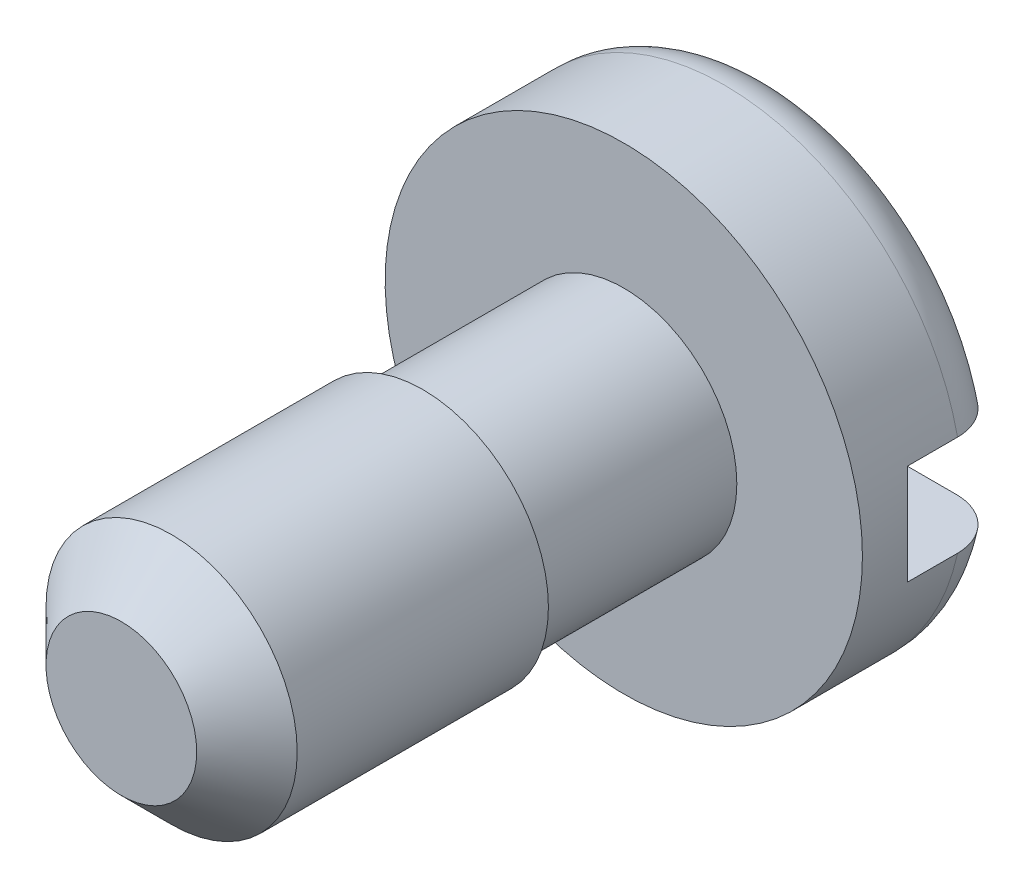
ISO-10303-21;
HEADER;
FILE_DESCRIPTION(('STEP AP214'),'2;1');
FILE_NAME('part.step','',(''),(''),'','','');
FILE_SCHEMA(('AUTOMOTIVE_DESIGN { 1 0 10303 214 1 1 1 1 }'));
ENDSEC;
DATA;
#1=APPLICATION_CONTEXT('core data for automotive mechanical design processes');
#2=APPLICATION_PROTOCOL_DEFINITION('international standard','automotive_design',2000,#1);
#3=PRODUCT_CONTEXT('',#1,'mechanical');
#4=PRODUCT('Part','Part','',(#3));
#5=PRODUCT_RELATED_PRODUCT_CATEGORY('part','',(#4));
#6=PRODUCT_DEFINITION_FORMATION('','',#4);
#7=PRODUCT_DEFINITION_CONTEXT('part definition',#1,'design');
#8=PRODUCT_DEFINITION('design','',#6,#7);
#9=PRODUCT_DEFINITION_SHAPE('','',#8);
#10=(LENGTH_UNIT() NAMED_UNIT(*) SI_UNIT(.MILLI.,.METRE.));
#11=(NAMED_UNIT(*) PLANE_ANGLE_UNIT() SI_UNIT($,.RADIAN.));
#12=(NAMED_UNIT(*) SI_UNIT($,.STERADIAN.) SOLID_ANGLE_UNIT());
#13=UNCERTAINTY_MEASURE_WITH_UNIT(LENGTH_MEASURE(1.E-05),#10,'distance_accuracy_value','');
#14=(GEOMETRIC_REPRESENTATION_CONTEXT(3) GLOBAL_UNCERTAINTY_ASSIGNED_CONTEXT((#13)) GLOBAL_UNIT_ASSIGNED_CONTEXT((#10,
#11,#12)) REPRESENTATION_CONTEXT('',''));
#15=CARTESIAN_POINT('',(0.,0.,0.));
#16=DIRECTION('',(0.,0.,1.));
#17=DIRECTION('',(1.,0.,0.));
#18=AXIS2_PLACEMENT_3D('',#15,#16,#17);
#19=CARTESIAN_POINT('',(0.,0.,0.));
#20=DIRECTION('',(0.,0.,1.));
#21=DIRECTION('',(1.,0.,0.));
#22=AXIS2_PLACEMENT_3D('',#19,#20,#21);
#23=PLANE('',#22);
#24=DIRECTION('',(-1.,0.,0.));
#25=VECTOR('',#24,1.);
#26=CARTESIAN_POINT('',(-25.3564560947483,-0.999999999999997,0.));
#27=LINE('',#26,#25);
#28=CARTESIAN_POINT('',(3.61420807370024,-1.,0.));
#29=VERTEX_POINT('',#28);
#30=CARTESIAN_POINT('',(-3.61420807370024,-1.,0.));
#31=VERTEX_POINT('',#30);
#32=EDGE_CURVE('E122',#29,#31,#27,.T.);
#33=ORIENTED_EDGE('',*,*,#32,.F.);
#34=CARTESIAN_POINT('',(0.,0.,0.));
#35=DIRECTION('',(0.,0.,1.));
#36=DIRECTION('',(1.,0.,0.));
#37=AXIS2_PLACEMENT_3D('',#34,#35,#36);
#38=CIRCLE('',#37,3.75);
#39=EDGE_CURVE('E190',#29,#31,#38,.F.);
#40=ORIENTED_EDGE('',*,*,#39,.T.);
#41=EDGE_LOOP('',(#33,#40));
#42=FACE_BOUND('',#41,.T.);
#43=ADVANCED_FACE('F33',(#42),#23,.F.);
#44=CARTESIAN_POINT('',(0.,0.,3.));
#45=DIRECTION('',(0.,0.,1.));
#46=DIRECTION('',(1.,0.,0.));
#47=AXIS2_PLACEMENT_3D('',#44,#45,#46);
#48=PLANE('',#47);
#49=CARTESIAN_POINT('',(0.,0.,3.));
#50=DIRECTION('',(0.,0.,1.));
#51=DIRECTION('',(1.,0.,0.));
#52=AXIS2_PLACEMENT_3D('',#49,#50,#51);
#53=CIRCLE('',#52,4.75);
#54=CARTESIAN_POINT('',(4.75,0.,3.));
#55=VERTEX_POINT('',#54);
#56=EDGE_CURVE('E108',#55,#55,#53,.T.);
#57=ORIENTED_EDGE('',*,*,#56,.T.);
#58=EDGE_LOOP('',(#57));
#59=FACE_BOUND('',#58,.T.);
#60=CARTESIAN_POINT('',(0.,0.,3.));
#61=DIRECTION('',(0.,0.,1.));
#62=DIRECTION('',(1.,0.,0.));
#63=AXIS2_PLACEMENT_3D('',#60,#61,#62);
#64=CIRCLE('',#63,2.25);
#65=CARTESIAN_POINT('',(2.25,0.,3.));
#66=VERTEX_POINT('',#65);
#67=EDGE_CURVE('E125',#66,#66,#64,.T.);
#68=ORIENTED_EDGE('',*,*,#67,.F.);
#69=EDGE_LOOP('',(#68));
#70=FACE_BOUND('',#69,.T.);
#71=ADVANCED_FACE('F217',(#59,#70),#48,.T.);
#72=CARTESIAN_POINT('',(0.,0.,3.));
#73=DIRECTION('',(0.,0.,-1.));
#74=DIRECTION('',(-1.,0.,0.));
#75=AXIS2_PLACEMENT_3D('',#72,#73,#74);
#76=CYLINDRICAL_SURFACE('',#75,4.75);
#77=DIRECTION('',(0.,0.,-1.));
#78=VECTOR('',#77,1.);
#79=CARTESIAN_POINT('',(4.64354390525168,0.999999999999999,3.));
#80=LINE('',#79,#78);
#81=CARTESIAN_POINT('',(4.64354390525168,0.999999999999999,2.));
#82=VERTEX_POINT('',#81);
#83=CARTESIAN_POINT('',(4.64354390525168,0.999999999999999,1.));
#84=VERTEX_POINT('',#83);
#85=EDGE_CURVE('E100',#82,#84,#80,.T.);
#86=ORIENTED_EDGE('',*,*,#85,.T.);
#87=CARTESIAN_POINT('',(0.,0.,1.));
#88=DIRECTION('',(0.,0.,1.));
#89=DIRECTION('',(1.,0.,0.));
#90=AXIS2_PLACEMENT_3D('',#87,#88,#89);
#91=CIRCLE('',#90,4.75);
#92=CARTESIAN_POINT('',(-4.64354390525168,1.,1.));
#93=VERTEX_POINT('',#92);
#94=EDGE_CURVE('E188',#84,#93,#91,.T.);
#95=ORIENTED_EDGE('',*,*,#94,.T.);
#96=DIRECTION('',(0.,0.,-1.));
#97=VECTOR('',#96,1.);
#98=CARTESIAN_POINT('',(-4.64354390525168,1.,3.));
#99=LINE('',#98,#97);
#100=CARTESIAN_POINT('',(-4.64354390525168,1.,2.));
#101=VERTEX_POINT('',#100);
#102=EDGE_CURVE('E107',#93,#101,#99,.F.);
#103=ORIENTED_EDGE('',*,*,#102,.T.);
#104=CARTESIAN_POINT('',(0.,0.,2.));
#105=DIRECTION('',(0.,0.,-1.));
#106=DIRECTION('',(-1.,0.,0.));
#107=AXIS2_PLACEMENT_3D('',#104,#105,#106);
#108=CIRCLE('',#107,4.75);
#109=CARTESIAN_POINT('',(-4.64354390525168,-1.,2.));
#110=VERTEX_POINT('',#109);
#111=EDGE_CURVE('E97',#110,#101,#108,.T.);
#112=ORIENTED_EDGE('',*,*,#111,.F.);
#113=DIRECTION('',(0.,0.,-1.));
#114=VECTOR('',#113,1.);
#115=CARTESIAN_POINT('',(-4.64354390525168,-1.,3.));
#116=LINE('',#115,#114);
#117=CARTESIAN_POINT('',(-4.64354390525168,-1.,1.));
#118=VERTEX_POINT('',#117);
#119=EDGE_CURVE('E126',#110,#118,#116,.T.);
#120=ORIENTED_EDGE('',*,*,#119,.T.);
#121=CARTESIAN_POINT('',(0.,0.,1.));
#122=DIRECTION('',(0.,0.,1.));
#123=DIRECTION('',(1.,0.,0.));
#124=AXIS2_PLACEMENT_3D('',#121,#122,#123);
#125=CIRCLE('',#124,4.75);
#126=CARTESIAN_POINT('',(4.64354390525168,-1.,1.));
#127=VERTEX_POINT('',#126);
#128=EDGE_CURVE('E138',#118,#127,#125,.T.);
#129=ORIENTED_EDGE('',*,*,#128,.T.);
#130=DIRECTION('',(0.,0.,-1.));
#131=VECTOR('',#130,1.);
#132=CARTESIAN_POINT('',(4.64354390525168,-1.,3.));
#133=LINE('',#132,#131);
#134=CARTESIAN_POINT('',(4.64354390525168,-1.,2.));
#135=VERTEX_POINT('',#134);
#136=EDGE_CURVE('E114',#135,#127,#133,.T.);
#137=ORIENTED_EDGE('',*,*,#136,.F.);
#138=CARTESIAN_POINT('',(4.64354390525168,1.,2.));
#139=DIRECTION('',(0.,-1.,0.));
#140=VECTOR('',#139,1.);
#141=LINE('',#138,#140);
#142=EDGE_CURVE('E93',#82,#135,#141,.T.);
#143=ORIENTED_EDGE('',*,*,#142,.F.);
#144=EDGE_LOOP('',(#86,#95,#103,#112,#120,#129,#137,#143));
#145=FACE_BOUND('',#144,.T.);
#146=ORIENTED_EDGE('',*,*,#56,.F.);
#147=EDGE_LOOP('',(#146));
#148=FACE_BOUND('',#147,.T.);
#149=ADVANCED_FACE('F35',(#145,#148),#76,.T.);
#150=DIRECTION('',(-1.,0.,0.));
#151=VECTOR('',#150,1.);
#152=CARTESIAN_POINT('',(0.,1.,0.));
#153=LINE('',#152,#151);
#154=CARTESIAN_POINT('',(3.61420807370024,1.,0.));
#155=VERTEX_POINT('',#154);
#156=CARTESIAN_POINT('',(-3.61420807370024,1.,0.));
#157=VERTEX_POINT('',#156);
#158=EDGE_CURVE('E123',#155,#157,#153,.T.);
#159=ORIENTED_EDGE('',*,*,#158,.T.);
#160=CARTESIAN_POINT('',(0.,0.,0.));
#161=DIRECTION('',(0.,0.,1.));
#162=DIRECTION('',(1.,0.,0.));
#163=AXIS2_PLACEMENT_3D('',#160,#161,#162);
#164=CIRCLE('',#163,3.75);
#165=EDGE_CURVE('E55',#157,#155,#164,.F.);
#166=ORIENTED_EDGE('',*,*,#165,.T.);
#167=EDGE_LOOP('',(#159,#166));
#168=FACE_BOUND('',#167,.T.);
#169=ADVANCED_FACE('F178',(#168),#23,.F.);
#170=CARTESIAN_POINT('',(0.,0.,7.));
#171=DIRECTION('',(0.,0.,-1.));
#172=DIRECTION('',(-1.,0.,0.));
#173=AXIS2_PLACEMENT_3D('',#170,#171,#172);
#174=CYLINDRICAL_SURFACE('',#173,2.25);
#175=CARTESIAN_POINT('',(0.,0.,7.));
#176=DIRECTION('',(0.,0.,1.));
#177=DIRECTION('',(1.,0.,0.));
#178=AXIS2_PLACEMENT_3D('',#175,#176,#177);
#179=CIRCLE('',#178,2.25);
#180=CARTESIAN_POINT('',(2.25,0.,7.));
#181=VERTEX_POINT('',#180);
#182=EDGE_CURVE('E129',#181,#181,#179,.T.);
#183=ORIENTED_EDGE('',*,*,#182,.F.);
#184=EDGE_LOOP('',(#183));
#185=FACE_BOUND('',#184,.T.);
#186=ORIENTED_EDGE('',*,*,#67,.T.);
#187=EDGE_LOOP('',(#186));
#188=FACE_BOUND('',#187,.T.);
#189=ADVANCED_FACE('F226',(#185,#188),#174,.T.);
#190=CARTESIAN_POINT('',(0.,0.,7.));
#191=DIRECTION('',(0.,0.,1.));
#192=DIRECTION('',(1.,0.,0.));
#193=AXIS2_PLACEMENT_3D('',#190,#191,#192);
#194=PLANE('',#193);
#195=CARTESIAN_POINT('',(0.,0.,7.));
#196=DIRECTION('',(0.,0.,1.));
#197=DIRECTION('',(1.,0.,0.));
#198=AXIS2_PLACEMENT_3D('',#195,#196,#197);
#199=CIRCLE('',#198,2.5);
#200=CARTESIAN_POINT('',(2.5,0.,7.));
#201=VERTEX_POINT('',#200);
#202=EDGE_CURVE('E132',#201,#201,#199,.T.);
#203=ORIENTED_EDGE('',*,*,#202,.F.);
#204=EDGE_LOOP('',(#203));
#205=FACE_BOUND('',#204,.T.);
#206=ORIENTED_EDGE('',*,*,#182,.T.);
#207=EDGE_LOOP('',(#206));
#208=FACE_BOUND('',#207,.T.);
#209=ADVANCED_FACE('F230',(#205,#208),#194,.F.);
#210=CARTESIAN_POINT('',(0.,0.,13.));
#211=DIRECTION('',(0.,0.,-1.));
#212=DIRECTION('',(-1.,0.,0.));
#213=AXIS2_PLACEMENT_3D('',#210,#211,#212);
#214=CYLINDRICAL_SURFACE('',#213,2.5);
#215=CARTESIAN_POINT('',(0.,0.,12.));
#216=DIRECTION('',(0.,0.,1.));
#217=DIRECTION('',(1.,0.,0.));
#218=AXIS2_PLACEMENT_3D('',#215,#216,#217);
#219=CIRCLE('',#218,2.5);
#220=CARTESIAN_POINT('',(2.5,0.,12.));
#221=VERTEX_POINT('',#220);
#222=EDGE_CURVE('E11',#221,#221,#219,.F.);
#223=ORIENTED_EDGE('',*,*,#222,.T.);
#224=EDGE_LOOP('',(#223));
#225=FACE_BOUND('',#224,.T.);
#226=ORIENTED_EDGE('',*,*,#202,.T.);
#227=EDGE_LOOP('',(#226));
#228=FACE_BOUND('',#227,.T.);
#229=ADVANCED_FACE('F239',(#225,#228),#214,.T.);
#230=CARTESIAN_POINT('',(0.,0.,13.));
#231=DIRECTION('',(0.,0.,1.));
#232=DIRECTION('',(1.,0.,0.));
#233=AXIS2_PLACEMENT_3D('',#230,#231,#232);
#234=PLANE('',#233);
#235=CARTESIAN_POINT('',(0.,0.,13.));
#236=DIRECTION('',(0.,0.,1.));
#237=DIRECTION('',(1.,0.,0.));
#238=AXIS2_PLACEMENT_3D('',#235,#236,#237);
#239=CIRCLE('',#238,1.49999999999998);
#240=CARTESIAN_POINT('',(1.49999999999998,0.,13.));
#241=VERTEX_POINT('',#240);
#242=EDGE_CURVE('E42',#241,#241,#239,.T.);
#243=ORIENTED_EDGE('',*,*,#242,.T.);
#244=EDGE_LOOP('',(#243));
#245=FACE_BOUND('',#244,.T.);
#246=ADVANCED_FACE('F237',(#245),#234,.T.);
#247=CARTESIAN_POINT('',(-25.3564560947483,1.,2.));
#248=DIRECTION('',(0.,1.,0.));
#249=DIRECTION('',(-1.,0.,0.));
#250=AXIS2_PLACEMENT_3D('',#247,#248,#249);
#251=PLANE('',#250);
#252=ORIENTED_EDGE('',*,*,#102,.F.);
#253=CARTESIAN_POINT('',(-4.64354390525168,1.,1.));
#254=CARTESIAN_POINT('',(-4.64354397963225,1.,0.972352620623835));
#255=CARTESIAN_POINT('',(-4.64237029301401,1.,0.944718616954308));
#256=CARTESIAN_POINT('',(-4.63768976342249,1.,0.889651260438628));
#257=CARTESIAN_POINT('',(-4.63418311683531,1.,0.862217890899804));
#258=CARTESIAN_POINT('',(-4.62020541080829,1.,0.780591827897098));
#259=CARTESIAN_POINT('',(-4.60627643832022,1.,0.726950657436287));
#260=CARTESIAN_POINT('',(-4.56962497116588,1.,0.622777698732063));
#261=CARTESIAN_POINT('',(-4.54689981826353,1.,0.572246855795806));
#262=CARTESIAN_POINT('',(-4.49335639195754,1.,0.475671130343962));
#263=CARTESIAN_POINT('',(-4.4625383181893,1.,0.429626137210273));
#264=CARTESIAN_POINT('',(-4.39344921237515,1.,0.342892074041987));
#265=CARTESIAN_POINT('',(-4.35511825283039,1.,0.302250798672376));
#266=CARTESIAN_POINT('',(-4.27230010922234,1.,0.227813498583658));
#267=CARTESIAN_POINT('',(-4.22781185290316,1.,0.194018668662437));
#268=CARTESIAN_POINT('',(-4.13294201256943,1.,0.133443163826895));
#269=CARTESIAN_POINT('',(-4.08245420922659,1.,0.106829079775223));
#270=CARTESIAN_POINT('',(-3.97781218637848,1.,0.0621951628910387));
#271=CARTESIAN_POINT('',(-3.92365819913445,1.,0.0441747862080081));
#272=CARTESIAN_POINT('',(-3.82684362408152,1.,0.0204248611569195));
#273=CARTESIAN_POINT('',(-3.78464532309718,1.,0.0127594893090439));
#274=CARTESIAN_POINT('',(-3.69970318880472,1.,0.00254706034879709));
#275=CARTESIAN_POINT('',(-3.6569603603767,1.,-8.34567958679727E-06));
#276=CARTESIAN_POINT('',(-3.61420807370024,1.,0.));
#277=B_SPLINE_CURVE_WITH_KNOTS('',3,(#253,#254,#255,#256,#257,#258,#259,#260,#261,#262,#263,
#264,#265,#266,#267,#268,#269,#270,#271,#272,#273,#274,#275,#276),.UNSPECIFIED.,.F.,.F.,(4,2,2,
2,2,2,2,2,2,2,2,4),(0.,0.0828907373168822,0.165774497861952,0.331179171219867,0.496633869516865,
0.662084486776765,0.828912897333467,0.995770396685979,1.16621858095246,1.33665597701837,
1.46502578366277,1.5931856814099),.UNSPECIFIED.);
#278=EDGE_CURVE('E49',#93,#157,#277,.T.);
#279=ORIENTED_EDGE('',*,*,#278,.T.);
#280=ORIENTED_EDGE('',*,*,#158,.F.);
#281=CARTESIAN_POINT('',(3.61420807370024,1.,0.));
#282=CARTESIAN_POINT('',(3.64388995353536,1.,6.09895041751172E-07));
#283=CARTESIAN_POINT('',(3.67355875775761,1.,0.00122834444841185));
#284=CARTESIAN_POINT('',(3.73269459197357,1.,0.00614207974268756));
#285=CARTESIAN_POINT('',(3.76216160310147,1.,0.00982830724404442));
#286=CARTESIAN_POINT('',(3.8499628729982,1.,0.0245761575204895));
#287=CARTESIAN_POINT('',(3.9077233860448,0.999999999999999,0.0393269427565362));
#288=CARTESIAN_POINT('',(4.0199606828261,0.999999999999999,0.0784071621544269));
#289=CARTESIAN_POINT('',(4.07443354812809,0.999999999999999,0.102747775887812));
#290=CARTESIAN_POINT('',(4.17836546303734,0.999999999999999,0.160426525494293));
#291=CARTESIAN_POINT('',(4.22782755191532,0.999999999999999,0.193759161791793));
#292=CARTESIAN_POINT('',(4.31914117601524,0.999999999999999,0.267703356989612));
#293=CARTESIAN_POINT('',(4.36113862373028,0.999999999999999,0.308134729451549));
#294=CARTESIAN_POINT('',(4.4375273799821,0.999999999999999,0.395665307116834));
#295=CARTESIAN_POINT('',(4.47191737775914,0.999999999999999,0.442765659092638));
#296=CARTESIAN_POINT('',(4.53112058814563,0.999999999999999,0.540887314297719));
#297=CARTESIAN_POINT('',(4.55616906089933,0.999999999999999,0.591766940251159));
#298=CARTESIAN_POINT('',(4.59716051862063,0.999999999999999,0.697047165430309));
#299=CARTESIAN_POINT('',(4.61311213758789,0.999999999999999,0.75144437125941));
#300=CARTESIAN_POINT('',(4.63067419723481,0.999999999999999,0.838575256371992));
#301=CARTESIAN_POINT('',(4.6354982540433,0.999999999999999,0.870694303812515));
#302=CARTESIAN_POINT('',(4.64193171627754,0.999999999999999,0.935203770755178));
#303=CARTESIAN_POINT('',(4.64354595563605,0.999999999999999,0.967593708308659));
#304=CARTESIAN_POINT('',(4.64354390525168,0.999999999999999,1.));
#305=B_SPLINE_CURVE_WITH_KNOTS('',3,(#281,#282,#283,#284,#285,#286,#287,#288,#289,#290,#291,
#292,#293,#294,#295,#296,#297,#298,#299,#300,#301,#302,#303,#304),.UNSPECIFIED.,.F.,.F.,(4,2,2,
2,2,2,2,2,2,2,2,4),(0.,0.0889935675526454,0.177995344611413,0.355921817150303,0.53405632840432,
0.712082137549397,0.886111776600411,1.06017137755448,1.22949170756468,1.39865106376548,
1.4959443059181,1.59309091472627),.UNSPECIFIED.);
#306=EDGE_CURVE('E103',#155,#84,#305,.T.);
#307=ORIENTED_EDGE('',*,*,#306,.T.);
#308=ORIENTED_EDGE('',*,*,#85,.F.);
#309=DIRECTION('',(1.,0.,0.));
#310=VECTOR('',#309,1.);
#311=CARTESIAN_POINT('',(-25.3564560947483,1.,2.));
#312=LINE('',#311,#310);
#313=EDGE_CURVE('E88',#101,#82,#312,.T.);
#314=ORIENTED_EDGE('',*,*,#313,.F.);
#315=EDGE_LOOP('',(#252,#279,#280,#307,#308,#314));
#316=FACE_BOUND('',#315,.T.);
#317=ADVANCED_FACE('F101',(#316),#251,.F.);
#318=CARTESIAN_POINT('',(-25.3564560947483,-0.999999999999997,2.));
#319=DIRECTION('',(0.,-1.,0.));
#320=DIRECTION('',(1.,0.,0.));
#321=AXIS2_PLACEMENT_3D('',#318,#319,#320);
#322=PLANE('',#321);
#323=ORIENTED_EDGE('',*,*,#136,.T.);
#324=CARTESIAN_POINT('',(4.64354390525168,-1.,1.));
#325=CARTESIAN_POINT('',(4.64354397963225,-1.,0.972352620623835));
#326=CARTESIAN_POINT('',(4.64237029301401,-1.,0.944718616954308));
#327=CARTESIAN_POINT('',(4.63768976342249,-1.,0.889651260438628));
#328=CARTESIAN_POINT('',(4.63418311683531,-1.,0.862217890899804));
#329=CARTESIAN_POINT('',(4.62020541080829,-1.,0.780591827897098));
#330=CARTESIAN_POINT('',(4.60627643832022,-1.,0.726950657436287));
#331=CARTESIAN_POINT('',(4.56962497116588,-1.,0.622777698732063));
#332=CARTESIAN_POINT('',(4.54689981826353,-1.,0.572246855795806));
#333=CARTESIAN_POINT('',(4.49335639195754,-1.,0.475671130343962));
#334=CARTESIAN_POINT('',(4.4625383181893,-1.,0.429626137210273));
#335=CARTESIAN_POINT('',(4.39344921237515,-1.,0.342892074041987));
#336=CARTESIAN_POINT('',(4.35511825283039,-1.,0.302250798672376));
#337=CARTESIAN_POINT('',(4.27230010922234,-1.,0.227813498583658));
#338=CARTESIAN_POINT('',(4.22781185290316,-1.,0.194018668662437));
#339=CARTESIAN_POINT('',(4.13294201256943,-1.,0.133443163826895));
#340=CARTESIAN_POINT('',(4.08245420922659,-1.,0.106829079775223));
#341=CARTESIAN_POINT('',(3.97781218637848,-1.,0.0621951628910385));
#342=CARTESIAN_POINT('',(3.92365819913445,-1.,0.0441747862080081));
#343=CARTESIAN_POINT('',(3.82684362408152,-1.,0.0204248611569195));
#344=CARTESIAN_POINT('',(3.78464532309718,-1.,0.0127594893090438));
#345=CARTESIAN_POINT('',(3.69970318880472,-1.,0.00254706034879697));
#346=CARTESIAN_POINT('',(3.6569603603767,-1.,-8.34567958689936E-06));
#347=CARTESIAN_POINT('',(3.61420807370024,-1.,0.));
#348=B_SPLINE_CURVE_WITH_KNOTS('',3,(#324,#325,#326,#327,#328,#329,#330,#331,#332,#333,#334,
#335,#336,#337,#338,#339,#340,#341,#342,#343,#344,#345,#346,#347),.UNSPECIFIED.,.F.,.F.,(4,2,2,
2,2,2,2,2,2,2,2,4),(0.,0.0828907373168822,0.165774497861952,0.331179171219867,0.496633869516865,
0.662084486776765,0.828912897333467,0.995770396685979,1.16621858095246,1.33665597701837,
1.46502578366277,1.59318568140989),.UNSPECIFIED.);
#349=EDGE_CURVE('E157',#127,#29,#348,.T.);
#350=ORIENTED_EDGE('',*,*,#349,.T.);
#351=ORIENTED_EDGE('',*,*,#32,.T.);
#352=CARTESIAN_POINT('',(-3.61420807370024,-1.,0.));
#353=CARTESIAN_POINT('',(-3.64388995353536,-1.,6.09895041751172E-07));
#354=CARTESIAN_POINT('',(-3.67355875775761,-1.,0.00122834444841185));
#355=CARTESIAN_POINT('',(-3.73269459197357,-1.,0.00614207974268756));
#356=CARTESIAN_POINT('',(-3.76216160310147,-1.,0.00982830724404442));
#357=CARTESIAN_POINT('',(-3.8499628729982,-1.,0.0245761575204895));
#358=CARTESIAN_POINT('',(-3.9077233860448,-0.999999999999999,0.0393269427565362));
#359=CARTESIAN_POINT('',(-4.0199606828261,-0.999999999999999,0.0784071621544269));
#360=CARTESIAN_POINT('',(-4.07443354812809,-0.999999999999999,0.102747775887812));
#361=CARTESIAN_POINT('',(-4.17836546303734,-0.999999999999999,0.160426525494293));
#362=CARTESIAN_POINT('',(-4.22782755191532,-0.999999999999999,0.193759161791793));
#363=CARTESIAN_POINT('',(-4.31914117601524,-0.999999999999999,0.267703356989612));
#364=CARTESIAN_POINT('',(-4.36113862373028,-0.999999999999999,0.308134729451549));
#365=CARTESIAN_POINT('',(-4.4375273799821,-0.999999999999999,0.395665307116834));
#366=CARTESIAN_POINT('',(-4.47191737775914,-0.999999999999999,0.442765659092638));
#367=CARTESIAN_POINT('',(-4.53112058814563,-0.999999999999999,0.540887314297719));
#368=CARTESIAN_POINT('',(-4.55616906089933,-0.999999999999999,0.591766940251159));
#369=CARTESIAN_POINT('',(-4.59716051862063,-0.999999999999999,0.697047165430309));
#370=CARTESIAN_POINT('',(-4.61311213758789,-0.999999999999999,0.75144437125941));
#371=CARTESIAN_POINT('',(-4.63067419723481,-0.999999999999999,0.838575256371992));
#372=CARTESIAN_POINT('',(-4.6354982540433,-0.999999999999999,0.870694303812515));
#373=CARTESIAN_POINT('',(-4.64193171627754,-0.999999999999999,0.935203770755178));
#374=CARTESIAN_POINT('',(-4.64354595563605,-0.999999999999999,0.967593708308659));
#375=CARTESIAN_POINT('',(-4.64354390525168,-0.999999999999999,1.));
#376=B_SPLINE_CURVE_WITH_KNOTS('',3,(#352,#353,#354,#355,#356,#357,#358,#359,#360,#361,#362,
#363,#364,#365,#366,#367,#368,#369,#370,#371,#372,#373,#374,#375),.UNSPECIFIED.,.F.,.F.,(4,2,2,
2,2,2,2,2,2,2,2,4),(0.,0.0889935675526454,0.177995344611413,0.355921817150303,0.53405632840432,
0.712082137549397,0.886111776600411,1.06017137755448,1.22949170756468,1.39865106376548,
1.4959443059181,1.59309091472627),.UNSPECIFIED.);
#377=EDGE_CURVE('E149',#31,#118,#376,.T.);
#378=ORIENTED_EDGE('',*,*,#377,.T.);
#379=ORIENTED_EDGE('',*,*,#119,.F.);
#380=DIRECTION('',(-1.,0.,0.));
#381=VECTOR('',#380,1.);
#382=CARTESIAN_POINT('',(-25.3564560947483,-0.999999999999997,2.));
#383=LINE('',#382,#381);
#384=EDGE_CURVE('E115',#135,#110,#383,.T.);
#385=ORIENTED_EDGE('',*,*,#384,.F.);
#386=EDGE_LOOP('',(#323,#350,#351,#378,#379,#385));
#387=FACE_BOUND('',#386,.T.);
#388=ADVANCED_FACE('F167',(#387),#322,.F.);
#389=CARTESIAN_POINT('',(-25.3564560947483,-0.999999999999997,2.));
#390=DIRECTION('',(0.,0.,-1.));
#391=DIRECTION('',(-1.,0.,0.));
#392=AXIS2_PLACEMENT_3D('',#389,#390,#391);
#393=PLANE('',#392);
#394=ORIENTED_EDGE('',*,*,#111,.T.);
#395=ORIENTED_EDGE('',*,*,#313,.T.);
#396=ORIENTED_EDGE('',*,*,#142,.T.);
#397=ORIENTED_EDGE('',*,*,#384,.T.);
#398=EDGE_LOOP('',(#394,#395,#396,#397));
#399=FACE_BOUND('',#398,.T.);
#400=ADVANCED_FACE('F90',(#399),#393,.T.);
#401=CARTESIAN_POINT('',(0.,0.,1.));
#402=DIRECTION('',(0.,0.,1.));
#403=DIRECTION('',(1.,0.,0.));
#404=AXIS2_PLACEMENT_3D('',#401,#402,#403);
#405=TOROIDAL_SURFACE('',#404,3.75,1.);
#406=ORIENTED_EDGE('',*,*,#377,.F.);
#407=ORIENTED_EDGE('',*,*,#39,.F.);
#408=ORIENTED_EDGE('',*,*,#349,.F.);
#409=ORIENTED_EDGE('',*,*,#128,.F.);
#410=EDGE_LOOP('',(#406,#407,#408,#409));
#411=FACE_BOUND('',#410,.T.);
#412=ADVANCED_FACE('F163',(#411),#405,.T.);
#413=CARTESIAN_POINT('',(0.,0.,1.));
#414=DIRECTION('',(0.,0.,1.));
#415=DIRECTION('',(1.,0.,0.));
#416=AXIS2_PLACEMENT_3D('',#413,#414,#415);
#417=TOROIDAL_SURFACE('',#416,3.75,1.);
#418=ORIENTED_EDGE('',*,*,#306,.F.);
#419=ORIENTED_EDGE('',*,*,#165,.F.);
#420=ORIENTED_EDGE('',*,*,#278,.F.);
#421=ORIENTED_EDGE('',*,*,#94,.F.);
#422=EDGE_LOOP('',(#418,#419,#420,#421));
#423=FACE_BOUND('',#422,.T.);
#424=ADVANCED_FACE('F203',(#423),#417,.T.);
#425=CARTESIAN_POINT('',(0.,0.,13.));
#426=DIRECTION('',(0.,0.,-1.));
#427=DIRECTION('',(-1.,0.,0.));
#428=AXIS2_PLACEMENT_3D('',#425,#426,#427);
#429=CONICAL_SURFACE('',#428,1.49999999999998,0.785398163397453);
#430=ORIENTED_EDGE('',*,*,#222,.F.);
#431=EDGE_LOOP('',(#430));
#432=FACE_BOUND('',#431,.T.);
#433=ORIENTED_EDGE('',*,*,#242,.F.);
#434=EDGE_LOOP('',(#433));
#435=FACE_BOUND('',#434,.T.);
#436=ADVANCED_FACE('F207',(#432,#435),#429,.T.);
#437=CLOSED_SHELL('',(#43,#71,#149,#169,#189,#209,#229,#246,#317,#388,#400,#412,#424,#436));
#438=MANIFOLD_SOLID_BREP('B2',#437);
#439=ADVANCED_BREP_SHAPE_REPRESENTATION('',(#18,#438),#14);
#440=SHAPE_DEFINITION_REPRESENTATION(#9,#439);
ENDSEC;
END-ISO-10303-21;
